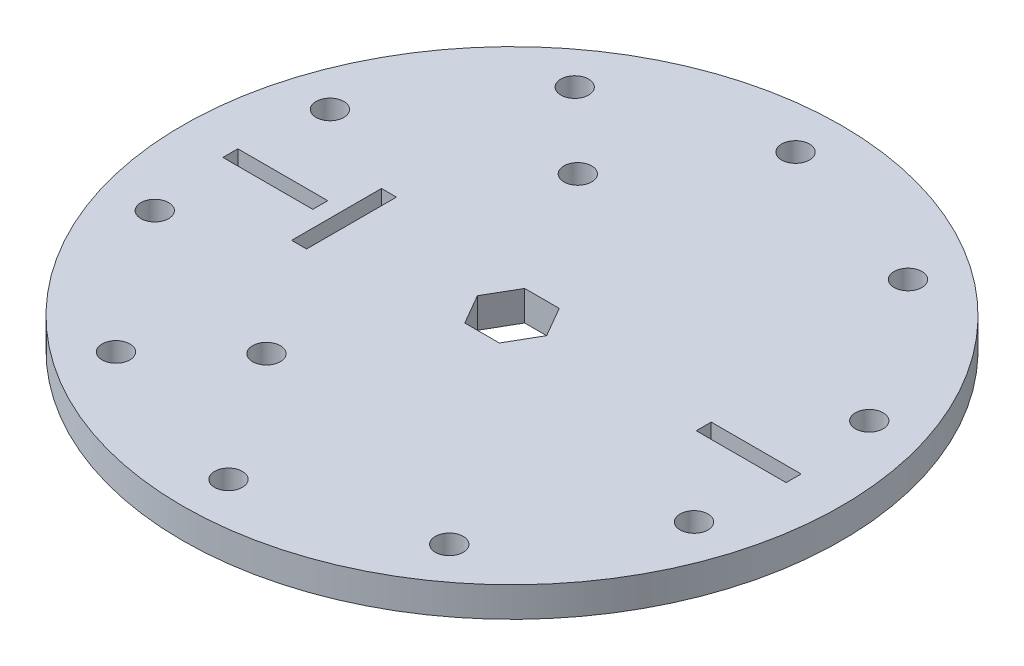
ISO-10303-21;
HEADER;
FILE_DESCRIPTION(('STEP AP214'),'2;1');
FILE_NAME('part.step','',(''),(''),'','','');
FILE_SCHEMA(('AUTOMOTIVE_DESIGN { 1 0 10303 214 1 1 1 1 }'));
ENDSEC;
DATA;
#1=APPLICATION_CONTEXT('core data for automotive mechanical design processes');
#2=APPLICATION_PROTOCOL_DEFINITION('international standard','automotive_design',2000,#1);
#3=PRODUCT_CONTEXT('',#1,'mechanical');
#4=PRODUCT('Part','Part','',(#3));
#5=PRODUCT_RELATED_PRODUCT_CATEGORY('part','',(#4));
#6=PRODUCT_DEFINITION_FORMATION('','',#4);
#7=PRODUCT_DEFINITION_CONTEXT('part definition',#1,'design');
#8=PRODUCT_DEFINITION('design','',#6,#7);
#9=PRODUCT_DEFINITION_SHAPE('','',#8);
#10=(LENGTH_UNIT() NAMED_UNIT(*) SI_UNIT(.MILLI.,.METRE.));
#11=(NAMED_UNIT(*) PLANE_ANGLE_UNIT() SI_UNIT($,.RADIAN.));
#12=(NAMED_UNIT(*) SI_UNIT($,.STERADIAN.) SOLID_ANGLE_UNIT());
#13=UNCERTAINTY_MEASURE_WITH_UNIT(LENGTH_MEASURE(1.E-05),#10,'distance_accuracy_value','');
#14=(GEOMETRIC_REPRESENTATION_CONTEXT(3) GLOBAL_UNCERTAINTY_ASSIGNED_CONTEXT((#13)) GLOBAL_UNIT_ASSIGNED_CONTEXT((#10,
#11,#12)) REPRESENTATION_CONTEXT('',''));
#15=CARTESIAN_POINT('',(0.,0.,0.));
#16=DIRECTION('',(0.,0.,1.));
#17=DIRECTION('',(1.,0.,0.));
#18=AXIS2_PLACEMENT_3D('',#15,#16,#17);
#19=CARTESIAN_POINT('',(0.,3.175,0.));
#20=DIRECTION('',(0.,1.,0.));
#21=DIRECTION('',(0.,0.,1.));
#22=AXIS2_PLACEMENT_3D('',#19,#20,#21);
#23=PLANE('',#22);
#24=DIRECTION('',(0.,0.,1.));
#25=VECTOR('',#24,1.);
#26=CARTESIAN_POINT('',(-18.5938102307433,3.175,-4.7625));
#27=LINE('',#26,#25);
#28=CARTESIAN_POINT('',(-18.5938102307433,3.175,-4.7625));
#29=VERTEX_POINT('',#28);
#30=CARTESIAN_POINT('',(-18.5938102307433,3.175,4.7625));
#31=VERTEX_POINT('',#30);
#32=EDGE_CURVE('E50',#29,#31,#27,.T.);
#33=ORIENTED_EDGE('',*,*,#32,.F.);
#34=DIRECTION('',(-1.,0.,0.));
#35=VECTOR('',#34,1.);
#36=CARTESIAN_POINT('',(-18.5938102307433,3.175,-4.7625));
#37=LINE('',#36,#35);
#38=CARTESIAN_POINT('',(-17.0063102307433,3.175,-4.7625));
#39=VERTEX_POINT('',#38);
#40=EDGE_CURVE('E178',#39,#29,#37,.T.);
#41=ORIENTED_EDGE('',*,*,#40,.F.);
#42=DIRECTION('',(0.,0.,-1.));
#43=VECTOR('',#42,1.);
#44=CARTESIAN_POINT('',(-17.0063102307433,3.175,-4.7625));
#45=LINE('',#44,#43);
#46=CARTESIAN_POINT('',(-17.0063102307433,3.175,4.7625));
#47=VERTEX_POINT('',#46);
#48=EDGE_CURVE('E181',#47,#39,#45,.T.);
#49=ORIENTED_EDGE('',*,*,#48,.F.);
#50=DIRECTION('',(1.,0.,0.));
#51=VECTOR('',#50,1.);
#52=CARTESIAN_POINT('',(-18.5938102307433,3.175,4.7625));
#53=LINE('',#52,#51);
#54=EDGE_CURVE('E187',#31,#47,#53,.T.);
#55=ORIENTED_EDGE('',*,*,#54,.F.);
#56=EDGE_LOOP('',(#33,#41,#49,#55));
#57=FACE_BOUND('',#56,.T.);
#58=DIRECTION('',(-1.,0.,0.));
#59=VECTOR('',#58,1.);
#60=CARTESIAN_POINT('',(29.845,3.175,-0.793749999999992));
#61=LINE('',#60,#59);
#62=CARTESIAN_POINT('',(29.845,3.175,-0.793749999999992));
#63=VERTEX_POINT('',#62);
#64=CARTESIAN_POINT('',(20.32,3.175,-0.793749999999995));
#65=VERTEX_POINT('',#64);
#66=EDGE_CURVE('E193',#63,#65,#61,.T.);
#67=ORIENTED_EDGE('',*,*,#66,.F.);
#68=DIRECTION('',(0.,0.,-1.));
#69=VECTOR('',#68,1.);
#70=CARTESIAN_POINT('',(29.845,3.175,-0.793749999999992));
#71=LINE('',#70,#69);
#72=CARTESIAN_POINT('',(29.845,3.175,0.793749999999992));
#73=VERTEX_POINT('',#72);
#74=EDGE_CURVE('E201',#73,#63,#71,.T.);
#75=ORIENTED_EDGE('',*,*,#74,.F.);
#76=DIRECTION('',(1.,0.,0.));
#77=VECTOR('',#76,1.);
#78=CARTESIAN_POINT('',(29.845,3.175,0.793749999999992));
#79=LINE('',#78,#77);
#80=CARTESIAN_POINT('',(20.32,3.175,0.793749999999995));
#81=VERTEX_POINT('',#80);
#82=EDGE_CURVE('E215',#81,#73,#79,.T.);
#83=ORIENTED_EDGE('',*,*,#82,.F.);
#84=DIRECTION('',(0.,0.,1.));
#85=VECTOR('',#84,1.);
#86=CARTESIAN_POINT('',(20.32,3.175,-0.793749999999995));
#87=LINE('',#86,#85);
#88=EDGE_CURVE('E212',#65,#81,#87,.T.);
#89=ORIENTED_EDGE('',*,*,#88,.F.);
#90=EDGE_LOOP('',(#67,#75,#83,#89));
#91=FACE_BOUND('',#90,.T.);
#92=DIRECTION('',(0.,0.,1.));
#93=VECTOR('',#92,1.);
#94=CARTESIAN_POINT('',(-29.845,3.175,-0.79375));
#95=LINE('',#94,#93);
#96=CARTESIAN_POINT('',(-29.845,3.175,-0.79375));
#97=VERTEX_POINT('',#96);
#98=CARTESIAN_POINT('',(-29.845,3.175,0.79375));
#99=VERTEX_POINT('',#98);
#100=EDGE_CURVE('E222',#97,#99,#95,.T.);
#101=ORIENTED_EDGE('',*,*,#100,.F.);
#102=DIRECTION('',(-1.,0.,0.));
#103=VECTOR('',#102,1.);
#104=CARTESIAN_POINT('',(-29.845,3.175,-0.79375));
#105=LINE('',#104,#103);
#106=CARTESIAN_POINT('',(-20.32,3.175,-0.79375));
#107=VERTEX_POINT('',#106);
#108=EDGE_CURVE('E233',#107,#97,#105,.T.);
#109=ORIENTED_EDGE('',*,*,#108,.F.);
#110=DIRECTION('',(0.,0.,-1.));
#111=VECTOR('',#110,1.);
#112=CARTESIAN_POINT('',(-20.32,3.175,-0.79375));
#113=LINE('',#112,#111);
#114=CARTESIAN_POINT('',(-20.32,3.175,0.79375));
#115=VERTEX_POINT('',#114);
#116=EDGE_CURVE('E247',#115,#107,#113,.T.);
#117=ORIENTED_EDGE('',*,*,#116,.F.);
#118=DIRECTION('',(1.,0.,0.));
#119=VECTOR('',#118,1.);
#120=CARTESIAN_POINT('',(-29.845,3.175,0.79375));
#121=LINE('',#120,#119);
#122=EDGE_CURVE('E244',#99,#115,#121,.T.);
#123=ORIENTED_EDGE('',*,*,#122,.F.);
#124=EDGE_LOOP('',(#101,#109,#117,#123));
#125=FACE_BOUND('',#124,.T.);
#126=CARTESIAN_POINT('',(-9.52499999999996,3.175,-16.4977839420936));
#127=DIRECTION('',(0.,1.,0.));
#128=DIRECTION('',(0.,0.,1.));
#129=AXIS2_PLACEMENT_3D('',#126,#127,#128);
#130=CIRCLE('',#129,1.47319999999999);
#131=CARTESIAN_POINT('',(-9.52499999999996,3.175,-15.0245839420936));
#132=VERTEX_POINT('',#131);
#133=EDGE_CURVE('E254',#132,#132,#130,.T.);
#134=ORIENTED_EDGE('',*,*,#133,.F.);
#135=EDGE_LOOP('',(#134));
#136=FACE_BOUND('',#135,.T.);
#137=CARTESIAN_POINT('',(-9.52499999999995,3.175,16.4977839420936));
#138=DIRECTION('',(0.,1.,0.));
#139=DIRECTION('',(0.,0.,1.));
#140=AXIS2_PLACEMENT_3D('',#137,#138,#139);
#141=CIRCLE('',#140,1.47319999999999);
#142=CARTESIAN_POINT('',(-9.52499999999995,3.175,17.9709839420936));
#143=VERTEX_POINT('',#142);
#144=EDGE_CURVE('E266',#143,#143,#141,.T.);
#145=ORIENTED_EDGE('',*,*,#144,.F.);
#146=EDGE_LOOP('',(#145));
#147=FACE_BOUND('',#146,.T.);
#148=CARTESIAN_POINT('',(0.,3.175,-30.0455330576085));
#149=DIRECTION('',(0.,1.,0.));
#150=DIRECTION('',(0.,0.,1.));
#151=AXIS2_PLACEMENT_3D('',#148,#149,#150);
#152=CIRCLE('',#151,1.4732);
#153=CARTESIAN_POINT('',(0.,3.175,-28.5723330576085));
#154=VERTEX_POINT('',#153);
#155=EDGE_CURVE('E272',#154,#154,#152,.T.);
#156=ORIENTED_EDGE('',*,*,#155,.F.);
#157=EDGE_LOOP('',(#156));
#158=FACE_BOUND('',#157,.T.);
#159=CARTESIAN_POINT('',(-17.6603212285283,3.175,-24.3073468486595));
#160=DIRECTION('',(0.,1.,0.));
#161=DIRECTION('',(0.,0.,1.));
#162=AXIS2_PLACEMENT_3D('',#159,#160,#161);
#163=CIRCLE('',#162,1.4732);
#164=CARTESIAN_POINT('',(-17.6603212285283,3.175,-22.8341468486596));
#165=VERTEX_POINT('',#164);
#166=EDGE_CURVE('E278',#165,#165,#163,.T.);
#167=ORIENTED_EDGE('',*,*,#166,.F.);
#168=EDGE_LOOP('',(#167));
#169=FACE_BOUND('',#168,.T.);
#170=CARTESIAN_POINT('',(-28.575,3.175,-9.2845803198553));
#171=DIRECTION('',(0.,1.,0.));
#172=DIRECTION('',(0.,0.,1.));
#173=AXIS2_PLACEMENT_3D('',#170,#171,#172);
#174=CIRCLE('',#173,1.4732);
#175=CARTESIAN_POINT('',(-28.575,3.175,-7.8113803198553));
#176=VERTEX_POINT('',#175);
#177=EDGE_CURVE('E284',#176,#176,#174,.T.);
#178=ORIENTED_EDGE('',*,*,#177,.F.);
#179=EDGE_LOOP('',(#178));
#180=FACE_BOUND('',#179,.T.);
#181=CARTESIAN_POINT('',(-28.575,3.175,9.28458031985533));
#182=DIRECTION('',(0.,1.,0.));
#183=DIRECTION('',(0.,0.,1.));
#184=AXIS2_PLACEMENT_3D('',#181,#182,#183);
#185=CIRCLE('',#184,1.4732);
#186=CARTESIAN_POINT('',(-28.575,3.175,10.7577803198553));
#187=VERTEX_POINT('',#186);
#188=EDGE_CURVE('E290',#187,#187,#185,.T.);
#189=ORIENTED_EDGE('',*,*,#188,.F.);
#190=EDGE_LOOP('',(#189));
#191=FACE_BOUND('',#190,.T.);
#192=CARTESIAN_POINT('',(-17.6603212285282,3.175,24.3073468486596));
#193=DIRECTION('',(0.,1.,0.));
#194=DIRECTION('',(0.,0.,1.));
#195=AXIS2_PLACEMENT_3D('',#192,#193,#194);
#196=CIRCLE('',#195,1.4732);
#197=CARTESIAN_POINT('',(-17.6603212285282,3.175,25.7805468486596));
#198=VERTEX_POINT('',#197);
#199=EDGE_CURVE('E296',#198,#198,#196,.T.);
#200=ORIENTED_EDGE('',*,*,#199,.F.);
#201=EDGE_LOOP('',(#200));
#202=FACE_BOUND('',#201,.T.);
#203=CARTESIAN_POINT('',(0.,3.175,30.0455330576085));
#204=DIRECTION('',(0.,1.,0.));
#205=DIRECTION('',(0.,0.,1.));
#206=AXIS2_PLACEMENT_3D('',#203,#204,#205);
#207=CIRCLE('',#206,1.4732);
#208=CARTESIAN_POINT('',(0.,3.175,31.5187330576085));
#209=VERTEX_POINT('',#208);
#210=EDGE_CURVE('E302',#209,#209,#207,.T.);
#211=ORIENTED_EDGE('',*,*,#210,.F.);
#212=EDGE_LOOP('',(#211));
#213=FACE_BOUND('',#212,.T.);
#214=CARTESIAN_POINT('',(17.6603212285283,3.175,24.3073468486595));
#215=DIRECTION('',(0.,1.,0.));
#216=DIRECTION('',(0.,0.,1.));
#217=AXIS2_PLACEMENT_3D('',#214,#215,#216);
#218=CIRCLE('',#217,1.4732);
#219=CARTESIAN_POINT('',(17.6603212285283,3.175,25.7805468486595));
#220=VERTEX_POINT('',#219);
#221=EDGE_CURVE('E308',#220,#220,#218,.T.);
#222=ORIENTED_EDGE('',*,*,#221,.F.);
#223=EDGE_LOOP('',(#222));
#224=FACE_BOUND('',#223,.T.);
#225=CARTESIAN_POINT('',(28.575,3.175,9.28458031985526));
#226=DIRECTION('',(0.,1.,0.));
#227=DIRECTION('',(0.,0.,1.));
#228=AXIS2_PLACEMENT_3D('',#225,#226,#227);
#229=CIRCLE('',#228,1.4732);
#230=CARTESIAN_POINT('',(28.575,3.175,10.7577803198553));
#231=VERTEX_POINT('',#230);
#232=EDGE_CURVE('E314',#231,#231,#229,.T.);
#233=ORIENTED_EDGE('',*,*,#232,.F.);
#234=EDGE_LOOP('',(#233));
#235=FACE_BOUND('',#234,.T.);
#236=CARTESIAN_POINT('',(28.575,3.175,-9.28458031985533));
#237=DIRECTION('',(0.,1.,0.));
#238=DIRECTION('',(0.,0.,1.));
#239=AXIS2_PLACEMENT_3D('',#236,#237,#238);
#240=CIRCLE('',#239,1.4732);
#241=CARTESIAN_POINT('',(28.575,3.175,-7.81138031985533));
#242=VERTEX_POINT('',#241);
#243=EDGE_CURVE('E320',#242,#242,#240,.T.);
#244=ORIENTED_EDGE('',*,*,#243,.F.);
#245=EDGE_LOOP('',(#244));
#246=FACE_BOUND('',#245,.T.);
#247=CARTESIAN_POINT('',(17.6603212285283,3.175,-24.3073468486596));
#248=DIRECTION('',(0.,1.,0.));
#249=DIRECTION('',(0.,0.,1.));
#250=AXIS2_PLACEMENT_3D('',#247,#248,#249);
#251=CIRCLE('',#250,1.4732);
#252=CARTESIAN_POINT('',(17.6603212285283,3.175,-22.8341468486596));
#253=VERTEX_POINT('',#252);
#254=EDGE_CURVE('E326',#253,#253,#251,.T.);
#255=ORIENTED_EDGE('',*,*,#254,.F.);
#256=EDGE_LOOP('',(#255));
#257=FACE_BOUND('',#256,.T.);
#258=CARTESIAN_POINT('',(0.,3.175,0.));
#259=DIRECTION('',(0.,1.,0.));
#260=DIRECTION('',(0.,0.,1.));
#261=AXIS2_PLACEMENT_3D('',#258,#259,#260);
#262=CIRCLE('',#261,34.925);
#263=CARTESIAN_POINT('',(0.,3.175,34.925));
#264=VERTEX_POINT('',#263);
#265=EDGE_CURVE('E11',#264,#264,#262,.T.);
#266=ORIENTED_EDGE('',*,*,#265,.T.);
#267=EDGE_LOOP('',(#266));
#268=FACE_BOUND('',#267,.T.);
#269=DIRECTION('',(-1.,0.,0.));
#270=VECTOR('',#269,1.);
#271=CARTESIAN_POINT('',(1.83308710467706,3.175,-3.175));
#272=LINE('',#271,#270);
#273=CARTESIAN_POINT('',(1.83308710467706,3.175,-3.175));
#274=VERTEX_POINT('',#273);
#275=CARTESIAN_POINT('',(-1.83308710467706,3.175,-3.175));
#276=VERTEX_POINT('',#275);
#277=EDGE_CURVE('E335',#274,#276,#272,.T.);
#278=ORIENTED_EDGE('',*,*,#277,.F.);
#279=DIRECTION('',(-0.5,0.,-0.866025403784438));
#280=VECTOR('',#279,1.);
#281=CARTESIAN_POINT('',(3.66617420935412,3.175,0.));
#282=LINE('',#281,#280);
#283=CARTESIAN_POINT('',(3.66617420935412,3.175,0.));
#284=VERTEX_POINT('',#283);
#285=EDGE_CURVE('E333',#284,#274,#282,.T.);
#286=ORIENTED_EDGE('',*,*,#285,.F.);
#287=DIRECTION('',(0.5,0.,-0.866025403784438));
#288=VECTOR('',#287,1.);
#289=CARTESIAN_POINT('',(1.83308710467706,3.175,3.175));
#290=LINE('',#289,#288);
#291=CARTESIAN_POINT('',(1.83308710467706,3.175,3.175));
#292=VERTEX_POINT('',#291);
#293=EDGE_CURVE('E345',#292,#284,#290,.T.);
#294=ORIENTED_EDGE('',*,*,#293,.F.);
#295=DIRECTION('',(1.,0.,0.));
#296=VECTOR('',#295,1.);
#297=CARTESIAN_POINT('',(-1.83308710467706,3.175,3.175));
#298=LINE('',#297,#296);
#299=CARTESIAN_POINT('',(-1.83308710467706,3.175,3.175));
#300=VERTEX_POINT('',#299);
#301=EDGE_CURVE('E342',#300,#292,#298,.T.);
#302=ORIENTED_EDGE('',*,*,#301,.F.);
#303=DIRECTION('',(0.5,0.,0.866025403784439));
#304=VECTOR('',#303,1.);
#305=CARTESIAN_POINT('',(-3.66617420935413,3.175,0.));
#306=LINE('',#305,#304);
#307=CARTESIAN_POINT('',(-3.66617420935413,3.175,0.));
#308=VERTEX_POINT('',#307);
#309=EDGE_CURVE('E340',#308,#300,#306,.T.);
#310=ORIENTED_EDGE('',*,*,#309,.F.);
#311=DIRECTION('',(-0.5,0.,0.866025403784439));
#312=VECTOR('',#311,1.);
#313=CARTESIAN_POINT('',(-1.83308710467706,3.175,-3.175));
#314=LINE('',#313,#312);
#315=EDGE_CURVE('E338',#276,#308,#314,.T.);
#316=ORIENTED_EDGE('',*,*,#315,.F.);
#317=EDGE_LOOP('',(#278,#286,#294,#302,#310,#316));
#318=FACE_BOUND('',#317,.T.);
#319=ADVANCED_FACE('F35',(#57,#91,#125,#136,#147,#158,#169,#180,#191,#202,#213,#224,#235,#246,
#257,#268,#318),#23,.T.);
#320=CARTESIAN_POINT('',(0.,0.,0.));
#321=DIRECTION('',(0.,1.,0.));
#322=DIRECTION('',(0.,0.,1.));
#323=AXIS2_PLACEMENT_3D('',#320,#321,#322);
#324=PLANE('',#323);
#325=DIRECTION('',(-1.,0.,0.));
#326=VECTOR('',#325,1.);
#327=CARTESIAN_POINT('',(-18.5938102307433,0.,-4.7625));
#328=LINE('',#327,#326);
#329=CARTESIAN_POINT('',(-17.0063102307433,0.,-4.7625));
#330=VERTEX_POINT('',#329);
#331=CARTESIAN_POINT('',(-18.5938102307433,0.,-4.7625));
#332=VERTEX_POINT('',#331);
#333=EDGE_CURVE('E168',#330,#332,#328,.T.);
#334=ORIENTED_EDGE('',*,*,#333,.T.);
#335=DIRECTION('',(0.,0.,1.));
#336=VECTOR('',#335,1.);
#337=CARTESIAN_POINT('',(-18.5938102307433,0.,-4.7625));
#338=LINE('',#337,#336);
#339=CARTESIAN_POINT('',(-18.5938102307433,0.,4.7625));
#340=VERTEX_POINT('',#339);
#341=EDGE_CURVE('E162',#332,#340,#338,.T.);
#342=ORIENTED_EDGE('',*,*,#341,.T.);
#343=DIRECTION('',(1.,0.,0.));
#344=VECTOR('',#343,1.);
#345=CARTESIAN_POINT('',(-18.5938102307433,0.,4.7625));
#346=LINE('',#345,#344);
#347=CARTESIAN_POINT('',(-17.0063102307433,0.,4.7625));
#348=VERTEX_POINT('',#347);
#349=EDGE_CURVE('E171',#340,#348,#346,.T.);
#350=ORIENTED_EDGE('',*,*,#349,.T.);
#351=DIRECTION('',(0.,0.,-1.));
#352=VECTOR('',#351,1.);
#353=CARTESIAN_POINT('',(-17.0063102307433,0.,-4.7625));
#354=LINE('',#353,#352);
#355=EDGE_CURVE('E58',#348,#330,#354,.T.);
#356=ORIENTED_EDGE('',*,*,#355,.T.);
#357=EDGE_LOOP('',(#334,#342,#350,#356));
#358=FACE_BOUND('',#357,.T.);
#359=DIRECTION('',(0.,0.,-1.));
#360=VECTOR('',#359,1.);
#361=CARTESIAN_POINT('',(29.845,0.,-0.793749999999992));
#362=LINE('',#361,#360);
#363=CARTESIAN_POINT('',(29.845,0.,0.793749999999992));
#364=VERTEX_POINT('',#363);
#365=CARTESIAN_POINT('',(29.845,0.,-0.793749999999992));
#366=VERTEX_POINT('',#365);
#367=EDGE_CURVE('E207',#364,#366,#362,.T.);
#368=ORIENTED_EDGE('',*,*,#367,.T.);
#369=DIRECTION('',(-1.,0.,0.));
#370=VECTOR('',#369,1.);
#371=CARTESIAN_POINT('',(29.845,0.,-0.793749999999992));
#372=LINE('',#371,#370);
#373=CARTESIAN_POINT('',(20.32,0.,-0.793749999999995));
#374=VERTEX_POINT('',#373);
#375=EDGE_CURVE('E197',#366,#374,#372,.T.);
#376=ORIENTED_EDGE('',*,*,#375,.T.);
#377=DIRECTION('',(0.,0.,1.));
#378=VECTOR('',#377,1.);
#379=CARTESIAN_POINT('',(20.32,0.,-0.793749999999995));
#380=LINE('',#379,#378);
#381=CARTESIAN_POINT('',(20.32,0.,0.793749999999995));
#382=VERTEX_POINT('',#381);
#383=EDGE_CURVE('E200',#374,#382,#380,.T.);
#384=ORIENTED_EDGE('',*,*,#383,.T.);
#385=DIRECTION('',(1.,0.,0.));
#386=VECTOR('',#385,1.);
#387=CARTESIAN_POINT('',(29.845,0.,0.793749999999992));
#388=LINE('',#387,#386);
#389=EDGE_CURVE('E204',#382,#364,#388,.T.);
#390=ORIENTED_EDGE('',*,*,#389,.T.);
#391=EDGE_LOOP('',(#368,#376,#384,#390));
#392=FACE_BOUND('',#391,.T.);
#393=DIRECTION('',(-1.,0.,0.));
#394=VECTOR('',#393,1.);
#395=CARTESIAN_POINT('',(-29.845,0.,-0.79375));
#396=LINE('',#395,#394);
#397=CARTESIAN_POINT('',(-20.32,0.,-0.79375));
#398=VERTEX_POINT('',#397);
#399=CARTESIAN_POINT('',(-29.845,0.,-0.79375));
#400=VERTEX_POINT('',#399);
#401=EDGE_CURVE('E239',#398,#400,#396,.T.);
#402=ORIENTED_EDGE('',*,*,#401,.T.);
#403=DIRECTION('',(0.,0.,1.));
#404=VECTOR('',#403,1.);
#405=CARTESIAN_POINT('',(-29.845,0.,-0.79375));
#406=LINE('',#405,#404);
#407=CARTESIAN_POINT('',(-29.845,0.,0.79375));
#408=VERTEX_POINT('',#407);
#409=EDGE_CURVE('E229',#400,#408,#406,.T.);
#410=ORIENTED_EDGE('',*,*,#409,.T.);
#411=DIRECTION('',(1.,0.,0.));
#412=VECTOR('',#411,1.);
#413=CARTESIAN_POINT('',(-29.845,0.,0.79375));
#414=LINE('',#413,#412);
#415=CARTESIAN_POINT('',(-20.32,0.,0.79375));
#416=VERTEX_POINT('',#415);
#417=EDGE_CURVE('E232',#408,#416,#414,.T.);
#418=ORIENTED_EDGE('',*,*,#417,.T.);
#419=DIRECTION('',(0.,0.,-1.));
#420=VECTOR('',#419,1.);
#421=CARTESIAN_POINT('',(-20.32,0.,-0.79375));
#422=LINE('',#421,#420);
#423=EDGE_CURVE('E236',#416,#398,#422,.T.);
#424=ORIENTED_EDGE('',*,*,#423,.T.);
#425=EDGE_LOOP('',(#402,#410,#418,#424));
#426=FACE_BOUND('',#425,.T.);
#427=CARTESIAN_POINT('',(-9.52499999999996,0.,-16.4977839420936));
#428=DIRECTION('',(0.,1.,0.));
#429=DIRECTION('',(0.,0.,1.));
#430=AXIS2_PLACEMENT_3D('',#427,#428,#429);
#431=CIRCLE('',#430,1.4732);
#432=CARTESIAN_POINT('',(-9.52499999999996,0.,-15.0245839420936));
#433=VERTEX_POINT('',#432);
#434=EDGE_CURVE('E263',#433,#433,#431,.T.);
#435=ORIENTED_EDGE('',*,*,#434,.T.);
#436=EDGE_LOOP('',(#435));
#437=FACE_BOUND('',#436,.T.);
#438=CARTESIAN_POINT('',(-9.52499999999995,0.,16.4977839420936));
#439=DIRECTION('',(0.,1.,0.));
#440=DIRECTION('',(0.,0.,1.));
#441=AXIS2_PLACEMENT_3D('',#438,#439,#440);
#442=CIRCLE('',#441,1.4732);
#443=CARTESIAN_POINT('',(-9.52499999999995,0.,17.9709839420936));
#444=VERTEX_POINT('',#443);
#445=EDGE_CURVE('E269',#444,#444,#442,.T.);
#446=ORIENTED_EDGE('',*,*,#445,.T.);
#447=EDGE_LOOP('',(#446));
#448=FACE_BOUND('',#447,.T.);
#449=CARTESIAN_POINT('',(0.,0.,-30.0455330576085));
#450=DIRECTION('',(0.,1.,0.));
#451=DIRECTION('',(0.,0.,1.));
#452=AXIS2_PLACEMENT_3D('',#449,#450,#451);
#453=CIRCLE('',#452,1.4732);
#454=CARTESIAN_POINT('',(0.,0.,-28.5723330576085));
#455=VERTEX_POINT('',#454);
#456=EDGE_CURVE('E275',#455,#455,#453,.T.);
#457=ORIENTED_EDGE('',*,*,#456,.T.);
#458=EDGE_LOOP('',(#457));
#459=FACE_BOUND('',#458,.T.);
#460=CARTESIAN_POINT('',(-17.6603212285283,0.,-24.3073468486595));
#461=DIRECTION('',(0.,1.,0.));
#462=DIRECTION('',(0.,0.,1.));
#463=AXIS2_PLACEMENT_3D('',#460,#461,#462);
#464=CIRCLE('',#463,1.4732);
#465=CARTESIAN_POINT('',(-17.6603212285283,0.,-22.8341468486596));
#466=VERTEX_POINT('',#465);
#467=EDGE_CURVE('E281',#466,#466,#464,.T.);
#468=ORIENTED_EDGE('',*,*,#467,.T.);
#469=EDGE_LOOP('',(#468));
#470=FACE_BOUND('',#469,.T.);
#471=CARTESIAN_POINT('',(-28.575,0.,-9.2845803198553));
#472=DIRECTION('',(0.,1.,0.));
#473=DIRECTION('',(0.,0.,1.));
#474=AXIS2_PLACEMENT_3D('',#471,#472,#473);
#475=CIRCLE('',#474,1.4732);
#476=CARTESIAN_POINT('',(-28.575,0.,-7.81138031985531));
#477=VERTEX_POINT('',#476);
#478=EDGE_CURVE('E287',#477,#477,#475,.T.);
#479=ORIENTED_EDGE('',*,*,#478,.T.);
#480=EDGE_LOOP('',(#479));
#481=FACE_BOUND('',#480,.T.);
#482=CARTESIAN_POINT('',(-28.575,0.,9.28458031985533));
#483=DIRECTION('',(0.,1.,0.));
#484=DIRECTION('',(0.,0.,1.));
#485=AXIS2_PLACEMENT_3D('',#482,#483,#484);
#486=CIRCLE('',#485,1.4732);
#487=CARTESIAN_POINT('',(-28.575,0.,10.7577803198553));
#488=VERTEX_POINT('',#487);
#489=EDGE_CURVE('E293',#488,#488,#486,.T.);
#490=ORIENTED_EDGE('',*,*,#489,.T.);
#491=EDGE_LOOP('',(#490));
#492=FACE_BOUND('',#491,.T.);
#493=CARTESIAN_POINT('',(-17.6603212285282,0.,24.3073468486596));
#494=DIRECTION('',(0.,1.,0.));
#495=DIRECTION('',(0.,0.,1.));
#496=AXIS2_PLACEMENT_3D('',#493,#494,#495);
#497=CIRCLE('',#496,1.4732);
#498=CARTESIAN_POINT('',(-17.6603212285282,0.,25.7805468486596));
#499=VERTEX_POINT('',#498);
#500=EDGE_CURVE('E299',#499,#499,#497,.T.);
#501=ORIENTED_EDGE('',*,*,#500,.T.);
#502=EDGE_LOOP('',(#501));
#503=FACE_BOUND('',#502,.T.);
#504=CARTESIAN_POINT('',(0.,0.,30.0455330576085));
#505=DIRECTION('',(0.,1.,0.));
#506=DIRECTION('',(0.,0.,1.));
#507=AXIS2_PLACEMENT_3D('',#504,#505,#506);
#508=CIRCLE('',#507,1.4732);
#509=CARTESIAN_POINT('',(0.,0.,31.5187330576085));
#510=VERTEX_POINT('',#509);
#511=EDGE_CURVE('E305',#510,#510,#508,.T.);
#512=ORIENTED_EDGE('',*,*,#511,.T.);
#513=EDGE_LOOP('',(#512));
#514=FACE_BOUND('',#513,.T.);
#515=CARTESIAN_POINT('',(17.6603212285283,0.,24.3073468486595));
#516=DIRECTION('',(0.,1.,0.));
#517=DIRECTION('',(0.,0.,1.));
#518=AXIS2_PLACEMENT_3D('',#515,#516,#517);
#519=CIRCLE('',#518,1.4732);
#520=CARTESIAN_POINT('',(17.6603212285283,0.,25.7805468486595));
#521=VERTEX_POINT('',#520);
#522=EDGE_CURVE('E311',#521,#521,#519,.T.);
#523=ORIENTED_EDGE('',*,*,#522,.T.);
#524=EDGE_LOOP('',(#523));
#525=FACE_BOUND('',#524,.T.);
#526=CARTESIAN_POINT('',(28.575,0.,9.28458031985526));
#527=DIRECTION('',(0.,1.,0.));
#528=DIRECTION('',(0.,0.,1.));
#529=AXIS2_PLACEMENT_3D('',#526,#527,#528);
#530=CIRCLE('',#529,1.4732);
#531=CARTESIAN_POINT('',(28.575,0.,10.7577803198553));
#532=VERTEX_POINT('',#531);
#533=EDGE_CURVE('E317',#532,#532,#530,.T.);
#534=ORIENTED_EDGE('',*,*,#533,.T.);
#535=EDGE_LOOP('',(#534));
#536=FACE_BOUND('',#535,.T.);
#537=CARTESIAN_POINT('',(28.575,0.,-9.28458031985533));
#538=DIRECTION('',(0.,1.,0.));
#539=DIRECTION('',(0.,0.,1.));
#540=AXIS2_PLACEMENT_3D('',#537,#538,#539);
#541=CIRCLE('',#540,1.4732);
#542=CARTESIAN_POINT('',(28.575,0.,-7.81138031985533));
#543=VERTEX_POINT('',#542);
#544=EDGE_CURVE('E323',#543,#543,#541,.T.);
#545=ORIENTED_EDGE('',*,*,#544,.T.);
#546=EDGE_LOOP('',(#545));
#547=FACE_BOUND('',#546,.T.);
#548=CARTESIAN_POINT('',(17.6603212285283,0.,-24.3073468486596));
#549=DIRECTION('',(0.,1.,0.));
#550=DIRECTION('',(0.,0.,1.));
#551=AXIS2_PLACEMENT_3D('',#548,#549,#550);
#552=CIRCLE('',#551,1.4732);
#553=CARTESIAN_POINT('',(17.6603212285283,0.,-22.8341468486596));
#554=VERTEX_POINT('',#553);
#555=EDGE_CURVE('E329',#554,#554,#552,.T.);
#556=ORIENTED_EDGE('',*,*,#555,.T.);
#557=EDGE_LOOP('',(#556));
#558=FACE_BOUND('',#557,.T.);
#559=CARTESIAN_POINT('',(0.,0.,0.));
#560=DIRECTION('',(0.,1.,0.));
#561=DIRECTION('',(0.,0.,1.));
#562=AXIS2_PLACEMENT_3D('',#559,#560,#561);
#563=CIRCLE('',#562,34.925);
#564=CARTESIAN_POINT('',(0.,0.,34.925));
#565=VERTEX_POINT('',#564);
#566=EDGE_CURVE('E39',#565,#565,#563,.T.);
#567=ORIENTED_EDGE('',*,*,#566,.F.);
#568=EDGE_LOOP('',(#567));
#569=FACE_BOUND('',#568,.T.);
#570=DIRECTION('',(-0.5,0.,-0.866025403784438));
#571=VECTOR('',#570,1.);
#572=CARTESIAN_POINT('',(3.66617420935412,0.,0.));
#573=LINE('',#572,#571);
#574=CARTESIAN_POINT('',(3.66617420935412,0.,0.));
#575=VERTEX_POINT('',#574);
#576=CARTESIAN_POINT('',(1.83308710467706,0.,-3.175));
#577=VERTEX_POINT('',#576);
#578=EDGE_CURVE('E332',#575,#577,#573,.T.);
#579=ORIENTED_EDGE('',*,*,#578,.T.);
#580=DIRECTION('',(-1.,0.,0.));
#581=VECTOR('',#580,1.);
#582=CARTESIAN_POINT('',(1.83308710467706,0.,-3.175));
#583=LINE('',#582,#581);
#584=CARTESIAN_POINT('',(-1.83308710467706,0.,-3.175));
#585=VERTEX_POINT('',#584);
#586=EDGE_CURVE('E350',#577,#585,#583,.T.);
#587=ORIENTED_EDGE('',*,*,#586,.T.);
#588=DIRECTION('',(-0.5,0.,0.866025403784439));
#589=VECTOR('',#588,1.);
#590=CARTESIAN_POINT('',(-1.83308710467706,0.,-3.175));
#591=LINE('',#590,#589);
#592=CARTESIAN_POINT('',(-3.66617420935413,0.,0.));
#593=VERTEX_POINT('',#592);
#594=EDGE_CURVE('E353',#585,#593,#591,.T.);
#595=ORIENTED_EDGE('',*,*,#594,.T.);
#596=DIRECTION('',(0.5,0.,0.866025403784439));
#597=VECTOR('',#596,1.);
#598=CARTESIAN_POINT('',(-3.66617420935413,0.,0.));
#599=LINE('',#598,#597);
#600=CARTESIAN_POINT('',(-1.83308710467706,0.,3.175));
#601=VERTEX_POINT('',#600);
#602=EDGE_CURVE('E356',#593,#601,#599,.T.);
#603=ORIENTED_EDGE('',*,*,#602,.T.);
#604=DIRECTION('',(1.,0.,0.));
#605=VECTOR('',#604,1.);
#606=CARTESIAN_POINT('',(-1.83308710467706,0.,3.175));
#607=LINE('',#606,#605);
#608=CARTESIAN_POINT('',(1.83308710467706,0.,3.175));
#609=VERTEX_POINT('',#608);
#610=EDGE_CURVE('E359',#601,#609,#607,.T.);
#611=ORIENTED_EDGE('',*,*,#610,.T.);
#612=DIRECTION('',(0.5,0.,-0.866025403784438));
#613=VECTOR('',#612,1.);
#614=CARTESIAN_POINT('',(1.83308710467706,0.,3.175));
#615=LINE('',#614,#613);
#616=EDGE_CURVE('E336',#609,#575,#615,.T.);
#617=ORIENTED_EDGE('',*,*,#616,.T.);
#618=EDGE_LOOP('',(#579,#587,#595,#603,#611,#617));
#619=FACE_BOUND('',#618,.T.);
#620=ADVANCED_FACE('F175',(#358,#392,#426,#437,#448,#459,#470,#481,#492,#503,#514,#525,#536,
#547,#558,#569,#619),#324,.F.);
#621=CARTESIAN_POINT('',(0.,3.175,0.));
#622=DIRECTION('',(0.,-1.,0.));
#623=DIRECTION('',(0.,0.,-1.));
#624=AXIS2_PLACEMENT_3D('',#621,#622,#623);
#625=CYLINDRICAL_SURFACE('',#624,34.925);
#626=ORIENTED_EDGE('',*,*,#265,.F.);
#627=EDGE_LOOP('',(#626));
#628=FACE_BOUND('',#627,.T.);
#629=ORIENTED_EDGE('',*,*,#566,.T.);
#630=EDGE_LOOP('',(#629));
#631=FACE_BOUND('',#630,.T.);
#632=ADVANCED_FACE('F37',(#628,#631),#625,.T.);
#633=CARTESIAN_POINT('',(3.66617420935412,3.175,0.));
#634=DIRECTION('',(-0.866025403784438,0.,0.5));
#635=DIRECTION('',(0.500000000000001,0.,0.866025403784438));
#636=AXIS2_PLACEMENT_3D('',#633,#634,#635);
#637=PLANE('',#636);
#638=ORIENTED_EDGE('',*,*,#578,.F.);
#639=DIRECTION('',(0.,-1.,0.));
#640=VECTOR('',#639,1.);
#641=CARTESIAN_POINT('',(3.66617420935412,3.175,0.));
#642=LINE('',#641,#640);
#643=EDGE_CURVE('E347',#284,#575,#642,.T.);
#644=ORIENTED_EDGE('',*,*,#643,.F.);
#645=ORIENTED_EDGE('',*,*,#285,.T.);
#646=DIRECTION('',(0.,-1.,0.));
#647=VECTOR('',#646,1.);
#648=CARTESIAN_POINT('',(1.83308710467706,3.175,-3.175));
#649=LINE('',#648,#647);
#650=EDGE_CURVE('E374',#274,#577,#649,.T.);
#651=ORIENTED_EDGE('',*,*,#650,.T.);
#652=EDGE_LOOP('',(#638,#644,#645,#651));
#653=FACE_BOUND('',#652,.T.);
#654=ADVANCED_FACE('F386',(#653),#637,.T.);
#655=CARTESIAN_POINT('',(1.83308710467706,3.175,-3.175));
#656=DIRECTION('',(0.,0.,1.));
#657=DIRECTION('',(1.,0.,0.));
#658=AXIS2_PLACEMENT_3D('',#655,#656,#657);
#659=PLANE('',#658);
#660=ORIENTED_EDGE('',*,*,#586,.F.);
#661=ORIENTED_EDGE('',*,*,#650,.F.);
#662=ORIENTED_EDGE('',*,*,#277,.T.);
#663=DIRECTION('',(0.,-1.,0.));
#664=VECTOR('',#663,1.);
#665=CARTESIAN_POINT('',(-1.83308710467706,3.175,-3.175));
#666=LINE('',#665,#664);
#667=EDGE_CURVE('E372',#276,#585,#666,.T.);
#668=ORIENTED_EDGE('',*,*,#667,.T.);
#669=EDGE_LOOP('',(#660,#661,#662,#668));
#670=FACE_BOUND('',#669,.T.);
#671=ADVANCED_FACE('F397',(#670),#659,.T.);
#672=CARTESIAN_POINT('',(-1.83308710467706,3.175,-3.175));
#673=DIRECTION('',(0.866025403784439,0.,0.5));
#674=DIRECTION('',(0.5,0.,-0.866025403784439));
#675=AXIS2_PLACEMENT_3D('',#672,#673,#674);
#676=PLANE('',#675);
#677=ORIENTED_EDGE('',*,*,#594,.F.);
#678=ORIENTED_EDGE('',*,*,#667,.F.);
#679=ORIENTED_EDGE('',*,*,#315,.T.);
#680=DIRECTION('',(0.,-1.,0.));
#681=VECTOR('',#680,1.);
#682=CARTESIAN_POINT('',(-3.66617420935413,3.175,0.));
#683=LINE('',#682,#681);
#684=EDGE_CURVE('E370',#308,#593,#683,.T.);
#685=ORIENTED_EDGE('',*,*,#684,.T.);
#686=EDGE_LOOP('',(#677,#678,#679,#685));
#687=FACE_BOUND('',#686,.T.);
#688=ADVANCED_FACE('F401',(#687),#676,.T.);
#689=CARTESIAN_POINT('',(-3.66617420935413,3.175,0.));
#690=DIRECTION('',(0.866025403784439,0.,-0.5));
#691=DIRECTION('',(-0.5,0.,-0.866025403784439));
#692=AXIS2_PLACEMENT_3D('',#689,#690,#691);
#693=PLANE('',#692);
#694=ORIENTED_EDGE('',*,*,#602,.F.);
#695=ORIENTED_EDGE('',*,*,#684,.F.);
#696=ORIENTED_EDGE('',*,*,#309,.T.);
#697=DIRECTION('',(0.,-1.,0.));
#698=VECTOR('',#697,1.);
#699=CARTESIAN_POINT('',(-1.83308710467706,3.175,3.175));
#700=LINE('',#699,#698);
#701=EDGE_CURVE('E368',#300,#601,#700,.T.);
#702=ORIENTED_EDGE('',*,*,#701,.T.);
#703=EDGE_LOOP('',(#694,#695,#696,#702));
#704=FACE_BOUND('',#703,.T.);
#705=ADVANCED_FACE('F406',(#704),#693,.T.);
#706=CARTESIAN_POINT('',(-1.83308710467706,3.175,3.175));
#707=DIRECTION('',(0.,0.,-1.));
#708=DIRECTION('',(-1.,0.,0.));
#709=AXIS2_PLACEMENT_3D('',#706,#707,#708);
#710=PLANE('',#709);
#711=ORIENTED_EDGE('',*,*,#610,.F.);
#712=ORIENTED_EDGE('',*,*,#701,.F.);
#713=ORIENTED_EDGE('',*,*,#301,.T.);
#714=DIRECTION('',(0.,-1.,0.));
#715=VECTOR('',#714,1.);
#716=CARTESIAN_POINT('',(1.83308710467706,3.175,3.175));
#717=LINE('',#716,#715);
#718=EDGE_CURVE('E366',#292,#609,#717,.T.);
#719=ORIENTED_EDGE('',*,*,#718,.T.);
#720=EDGE_LOOP('',(#711,#712,#713,#719));
#721=FACE_BOUND('',#720,.T.);
#722=ADVANCED_FACE('F409',(#721),#710,.T.);
#723=CARTESIAN_POINT('',(1.83308710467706,3.175,3.175));
#724=DIRECTION('',(-0.866025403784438,0.,-0.5));
#725=DIRECTION('',(-0.5,0.,0.866025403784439));
#726=AXIS2_PLACEMENT_3D('',#723,#724,#725);
#727=PLANE('',#726);
#728=ORIENTED_EDGE('',*,*,#616,.F.);
#729=ORIENTED_EDGE('',*,*,#718,.F.);
#730=ORIENTED_EDGE('',*,*,#293,.T.);
#731=ORIENTED_EDGE('',*,*,#643,.T.);
#732=EDGE_LOOP('',(#728,#729,#730,#731));
#733=FACE_BOUND('',#732,.T.);
#734=ADVANCED_FACE('F389',(#733),#727,.T.);
#735=CARTESIAN_POINT('',(17.6603212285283,3.175,-24.3073468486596));
#736=DIRECTION('',(0.,1.,0.));
#737=DIRECTION('',(0.,0.,1.));
#738=AXIS2_PLACEMENT_3D('',#735,#736,#737);
#739=CYLINDRICAL_SURFACE('',#738,1.4732);
#740=ORIENTED_EDGE('',*,*,#555,.F.);
#741=EDGE_LOOP('',(#740));
#742=FACE_BOUND('',#741,.T.);
#743=ORIENTED_EDGE('',*,*,#254,.T.);
#744=EDGE_LOOP('',(#743));
#745=FACE_BOUND('',#744,.T.);
#746=ADVANCED_FACE('F416',(#742,#745),#739,.F.);
#747=CARTESIAN_POINT('',(28.575,3.175,-9.28458031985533));
#748=DIRECTION('',(0.,1.,0.));
#749=DIRECTION('',(0.,0.,1.));
#750=AXIS2_PLACEMENT_3D('',#747,#748,#749);
#751=CYLINDRICAL_SURFACE('',#750,1.4732);
#752=ORIENTED_EDGE('',*,*,#544,.F.);
#753=EDGE_LOOP('',(#752));
#754=FACE_BOUND('',#753,.T.);
#755=ORIENTED_EDGE('',*,*,#243,.T.);
#756=EDGE_LOOP('',(#755));
#757=FACE_BOUND('',#756,.T.);
#758=ADVANCED_FACE('F458',(#754,#757),#751,.F.);
#759=CARTESIAN_POINT('',(28.575,3.175,9.28458031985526));
#760=DIRECTION('',(0.,1.,0.));
#761=DIRECTION('',(0.,0.,1.));
#762=AXIS2_PLACEMENT_3D('',#759,#760,#761);
#763=CYLINDRICAL_SURFACE('',#762,1.4732);
#764=ORIENTED_EDGE('',*,*,#533,.F.);
#765=EDGE_LOOP('',(#764));
#766=FACE_BOUND('',#765,.T.);
#767=ORIENTED_EDGE('',*,*,#232,.T.);
#768=EDGE_LOOP('',(#767));
#769=FACE_BOUND('',#768,.T.);
#770=ADVANCED_FACE('F468',(#766,#769),#763,.F.);
#771=CARTESIAN_POINT('',(17.6603212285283,3.175,24.3073468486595));
#772=DIRECTION('',(0.,1.,0.));
#773=DIRECTION('',(0.,0.,1.));
#774=AXIS2_PLACEMENT_3D('',#771,#772,#773);
#775=CYLINDRICAL_SURFACE('',#774,1.4732);
#776=ORIENTED_EDGE('',*,*,#522,.F.);
#777=EDGE_LOOP('',(#776));
#778=FACE_BOUND('',#777,.T.);
#779=ORIENTED_EDGE('',*,*,#221,.T.);
#780=EDGE_LOOP('',(#779));
#781=FACE_BOUND('',#780,.T.);
#782=ADVANCED_FACE('F478',(#778,#781),#775,.F.);
#783=CARTESIAN_POINT('',(0.,3.175,30.0455330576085));
#784=DIRECTION('',(0.,1.,0.));
#785=DIRECTION('',(0.,0.,1.));
#786=AXIS2_PLACEMENT_3D('',#783,#784,#785);
#787=CYLINDRICAL_SURFACE('',#786,1.4732);
#788=ORIENTED_EDGE('',*,*,#511,.F.);
#789=EDGE_LOOP('',(#788));
#790=FACE_BOUND('',#789,.T.);
#791=ORIENTED_EDGE('',*,*,#210,.T.);
#792=EDGE_LOOP('',(#791));
#793=FACE_BOUND('',#792,.T.);
#794=ADVANCED_FACE('F488',(#790,#793),#787,.F.);
#795=CARTESIAN_POINT('',(-17.6603212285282,3.175,24.3073468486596));
#796=DIRECTION('',(0.,1.,0.));
#797=DIRECTION('',(0.,0.,1.));
#798=AXIS2_PLACEMENT_3D('',#795,#796,#797);
#799=CYLINDRICAL_SURFACE('',#798,1.4732);
#800=ORIENTED_EDGE('',*,*,#500,.F.);
#801=EDGE_LOOP('',(#800));
#802=FACE_BOUND('',#801,.T.);
#803=ORIENTED_EDGE('',*,*,#199,.T.);
#804=EDGE_LOOP('',(#803));
#805=FACE_BOUND('',#804,.T.);
#806=ADVANCED_FACE('F498',(#802,#805),#799,.F.);
#807=CARTESIAN_POINT('',(-28.575,3.175,9.28458031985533));
#808=DIRECTION('',(0.,1.,0.));
#809=DIRECTION('',(0.,0.,1.));
#810=AXIS2_PLACEMENT_3D('',#807,#808,#809);
#811=CYLINDRICAL_SURFACE('',#810,1.4732);
#812=ORIENTED_EDGE('',*,*,#489,.F.);
#813=EDGE_LOOP('',(#812));
#814=FACE_BOUND('',#813,.T.);
#815=ORIENTED_EDGE('',*,*,#188,.T.);
#816=EDGE_LOOP('',(#815));
#817=FACE_BOUND('',#816,.T.);
#818=ADVANCED_FACE('F508',(#814,#817),#811,.F.);
#819=CARTESIAN_POINT('',(-28.575,3.175,-9.2845803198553));
#820=DIRECTION('',(0.,1.,0.));
#821=DIRECTION('',(0.,0.,1.));
#822=AXIS2_PLACEMENT_3D('',#819,#820,#821);
#823=CYLINDRICAL_SURFACE('',#822,1.4732);
#824=ORIENTED_EDGE('',*,*,#478,.F.);
#825=EDGE_LOOP('',(#824));
#826=FACE_BOUND('',#825,.T.);
#827=ORIENTED_EDGE('',*,*,#177,.T.);
#828=EDGE_LOOP('',(#827));
#829=FACE_BOUND('',#828,.T.);
#830=ADVANCED_FACE('F518',(#826,#829),#823,.F.);
#831=CARTESIAN_POINT('',(-17.6603212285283,3.175,-24.3073468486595));
#832=DIRECTION('',(0.,1.,0.));
#833=DIRECTION('',(0.,0.,1.));
#834=AXIS2_PLACEMENT_3D('',#831,#832,#833);
#835=CYLINDRICAL_SURFACE('',#834,1.4732);
#836=ORIENTED_EDGE('',*,*,#467,.F.);
#837=EDGE_LOOP('',(#836));
#838=FACE_BOUND('',#837,.T.);
#839=ORIENTED_EDGE('',*,*,#166,.T.);
#840=EDGE_LOOP('',(#839));
#841=FACE_BOUND('',#840,.T.);
#842=ADVANCED_FACE('F528',(#838,#841),#835,.F.);
#843=CARTESIAN_POINT('',(0.,3.175,-30.0455330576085));
#844=DIRECTION('',(0.,1.,0.));
#845=DIRECTION('',(0.,0.,1.));
#846=AXIS2_PLACEMENT_3D('',#843,#844,#845);
#847=CYLINDRICAL_SURFACE('',#846,1.4732);
#848=ORIENTED_EDGE('',*,*,#456,.F.);
#849=EDGE_LOOP('',(#848));
#850=FACE_BOUND('',#849,.T.);
#851=ORIENTED_EDGE('',*,*,#155,.T.);
#852=EDGE_LOOP('',(#851));
#853=FACE_BOUND('',#852,.T.);
#854=ADVANCED_FACE('F538',(#850,#853),#847,.F.);
#855=CARTESIAN_POINT('',(-9.52499999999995,3.175,16.4977839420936));
#856=DIRECTION('',(0.,1.,0.));
#857=DIRECTION('',(0.,0.,1.));
#858=AXIS2_PLACEMENT_3D('',#855,#856,#857);
#859=CYLINDRICAL_SURFACE('',#858,1.47319999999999);
#860=ORIENTED_EDGE('',*,*,#445,.F.);
#861=EDGE_LOOP('',(#860));
#862=FACE_BOUND('',#861,.T.);
#863=ORIENTED_EDGE('',*,*,#144,.T.);
#864=EDGE_LOOP('',(#863));
#865=FACE_BOUND('',#864,.T.);
#866=ADVANCED_FACE('F548',(#862,#865),#859,.F.);
#867=CARTESIAN_POINT('',(-9.52499999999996,3.175,-16.4977839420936));
#868=DIRECTION('',(0.,1.,0.));
#869=DIRECTION('',(0.,0.,1.));
#870=AXIS2_PLACEMENT_3D('',#867,#868,#869);
#871=CYLINDRICAL_SURFACE('',#870,1.47319999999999);
#872=ORIENTED_EDGE('',*,*,#434,.F.);
#873=EDGE_LOOP('',(#872));
#874=FACE_BOUND('',#873,.T.);
#875=ORIENTED_EDGE('',*,*,#133,.T.);
#876=EDGE_LOOP('',(#875));
#877=FACE_BOUND('',#876,.T.);
#878=ADVANCED_FACE('F558',(#874,#877),#871,.F.);
#879=CARTESIAN_POINT('',(-29.845,0.,-0.79375));
#880=DIRECTION('',(-1.,0.,0.));
#881=DIRECTION('',(0.,0.,1.));
#882=AXIS2_PLACEMENT_3D('',#879,#880,#881);
#883=PLANE('',#882);
#884=ORIENTED_EDGE('',*,*,#100,.T.);
#885=DIRECTION('',(0.,1.,0.));
#886=VECTOR('',#885,1.);
#887=CARTESIAN_POINT('',(-29.845,0.,0.79375));
#888=LINE('',#887,#886);
#889=EDGE_CURVE('E242',#408,#99,#888,.T.);
#890=ORIENTED_EDGE('',*,*,#889,.F.);
#891=ORIENTED_EDGE('',*,*,#409,.F.);
#892=DIRECTION('',(0.,1.,0.));
#893=VECTOR('',#892,1.);
#894=CARTESIAN_POINT('',(-29.845,0.,-0.79375));
#895=LINE('',#894,#893);
#896=EDGE_CURVE('E252',#400,#97,#895,.T.);
#897=ORIENTED_EDGE('',*,*,#896,.T.);
#898=EDGE_LOOP('',(#884,#890,#891,#897));
#899=FACE_BOUND('',#898,.T.);
#900=ADVANCED_FACE('F568',(#899),#883,.F.);
#901=CARTESIAN_POINT('',(-29.845,0.,-0.79375));
#902=DIRECTION('',(0.,0.,-1.));
#903=DIRECTION('',(-1.,0.,0.));
#904=AXIS2_PLACEMENT_3D('',#901,#902,#903);
#905=PLANE('',#904);
#906=ORIENTED_EDGE('',*,*,#108,.T.);
#907=ORIENTED_EDGE('',*,*,#896,.F.);
#908=ORIENTED_EDGE('',*,*,#401,.F.);
#909=DIRECTION('',(0.,1.,0.));
#910=VECTOR('',#909,1.);
#911=CARTESIAN_POINT('',(-20.32,0.,-0.79375));
#912=LINE('',#911,#910);
#913=EDGE_CURVE('E255',#398,#107,#912,.T.);
#914=ORIENTED_EDGE('',*,*,#913,.T.);
#915=EDGE_LOOP('',(#906,#907,#908,#914));
#916=FACE_BOUND('',#915,.T.);
#917=ADVANCED_FACE('F578',(#916),#905,.F.);
#918=CARTESIAN_POINT('',(-20.32,0.,-0.79375));
#919=DIRECTION('',(1.,0.,0.));
#920=DIRECTION('',(0.,0.,-1.));
#921=AXIS2_PLACEMENT_3D('',#918,#919,#920);
#922=PLANE('',#921);
#923=ORIENTED_EDGE('',*,*,#116,.T.);
#924=ORIENTED_EDGE('',*,*,#913,.F.);
#925=ORIENTED_EDGE('',*,*,#423,.F.);
#926=DIRECTION('',(0.,1.,0.));
#927=VECTOR('',#926,1.);
#928=CARTESIAN_POINT('',(-20.32,0.,0.79375));
#929=LINE('',#928,#927);
#930=EDGE_CURVE('E257',#416,#115,#929,.T.);
#931=ORIENTED_EDGE('',*,*,#930,.T.);
#932=EDGE_LOOP('',(#923,#924,#925,#931));
#933=FACE_BOUND('',#932,.T.);
#934=ADVANCED_FACE('F588',(#933),#922,.F.);
#935=CARTESIAN_POINT('',(-29.845,0.,0.79375));
#936=DIRECTION('',(0.,0.,1.));
#937=DIRECTION('',(1.,0.,0.));
#938=AXIS2_PLACEMENT_3D('',#935,#936,#937);
#939=PLANE('',#938);
#940=ORIENTED_EDGE('',*,*,#122,.T.);
#941=ORIENTED_EDGE('',*,*,#930,.F.);
#942=ORIENTED_EDGE('',*,*,#417,.F.);
#943=ORIENTED_EDGE('',*,*,#889,.T.);
#944=EDGE_LOOP('',(#940,#941,#942,#943));
#945=FACE_BOUND('',#944,.T.);
#946=ADVANCED_FACE('F598',(#945),#939,.F.);
#947=CARTESIAN_POINT('',(29.845,0.,-0.793749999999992));
#948=DIRECTION('',(0.,0.,-1.));
#949=DIRECTION('',(-1.,0.,0.));
#950=AXIS2_PLACEMENT_3D('',#947,#948,#949);
#951=PLANE('',#950);
#952=ORIENTED_EDGE('',*,*,#66,.T.);
#953=DIRECTION('',(0.,1.,0.));
#954=VECTOR('',#953,1.);
#955=CARTESIAN_POINT('',(20.32,0.,-0.793749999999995));
#956=LINE('',#955,#954);
#957=EDGE_CURVE('E210',#374,#65,#956,.T.);
#958=ORIENTED_EDGE('',*,*,#957,.F.);
#959=ORIENTED_EDGE('',*,*,#375,.F.);
#960=DIRECTION('',(0.,1.,0.));
#961=VECTOR('',#960,1.);
#962=CARTESIAN_POINT('',(29.845,0.,-0.793749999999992));
#963=LINE('',#962,#961);
#964=EDGE_CURVE('E220',#366,#63,#963,.T.);
#965=ORIENTED_EDGE('',*,*,#964,.T.);
#966=EDGE_LOOP('',(#952,#958,#959,#965));
#967=FACE_BOUND('',#966,.T.);
#968=ADVANCED_FACE('F608',(#967),#951,.F.);
#969=CARTESIAN_POINT('',(29.845,0.,-0.793749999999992));
#970=DIRECTION('',(1.,0.,0.));
#971=DIRECTION('',(0.,0.,-1.));
#972=AXIS2_PLACEMENT_3D('',#969,#970,#971);
#973=PLANE('',#972);
#974=ORIENTED_EDGE('',*,*,#74,.T.);
#975=ORIENTED_EDGE('',*,*,#964,.F.);
#976=ORIENTED_EDGE('',*,*,#367,.F.);
#977=DIRECTION('',(0.,1.,0.));
#978=VECTOR('',#977,1.);
#979=CARTESIAN_POINT('',(29.845,0.,0.793749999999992));
#980=LINE('',#979,#978);
#981=EDGE_CURVE('E223',#364,#73,#980,.T.);
#982=ORIENTED_EDGE('',*,*,#981,.T.);
#983=EDGE_LOOP('',(#974,#975,#976,#982));
#984=FACE_BOUND('',#983,.T.);
#985=ADVANCED_FACE('F618',(#984),#973,.F.);
#986=CARTESIAN_POINT('',(29.845,0.,0.793749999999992));
#987=DIRECTION('',(0.,0.,1.));
#988=DIRECTION('',(1.,0.,0.));
#989=AXIS2_PLACEMENT_3D('',#986,#987,#988);
#990=PLANE('',#989);
#991=ORIENTED_EDGE('',*,*,#82,.T.);
#992=ORIENTED_EDGE('',*,*,#981,.F.);
#993=ORIENTED_EDGE('',*,*,#389,.F.);
#994=DIRECTION('',(0.,1.,0.));
#995=VECTOR('',#994,1.);
#996=CARTESIAN_POINT('',(20.32,0.,0.793749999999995));
#997=LINE('',#996,#995);
#998=EDGE_CURVE('E225',#382,#81,#997,.T.);
#999=ORIENTED_EDGE('',*,*,#998,.T.);
#1000=EDGE_LOOP('',(#991,#992,#993,#999));
#1001=FACE_BOUND('',#1000,.T.);
#1002=ADVANCED_FACE('F628',(#1001),#990,.F.);
#1003=CARTESIAN_POINT('',(20.32,0.,-0.793749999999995));
#1004=DIRECTION('',(-1.,0.,0.));
#1005=DIRECTION('',(0.,0.,1.));
#1006=AXIS2_PLACEMENT_3D('',#1003,#1004,#1005);
#1007=PLANE('',#1006);
#1008=ORIENTED_EDGE('',*,*,#88,.T.);
#1009=ORIENTED_EDGE('',*,*,#998,.F.);
#1010=ORIENTED_EDGE('',*,*,#383,.F.);
#1011=ORIENTED_EDGE('',*,*,#957,.T.);
#1012=EDGE_LOOP('',(#1008,#1009,#1010,#1011));
#1013=FACE_BOUND('',#1012,.T.);
#1014=ADVANCED_FACE('F638',(#1013),#1007,.F.);
#1015=CARTESIAN_POINT('',(-18.5938102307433,0.,-4.7625));
#1016=DIRECTION('',(-1.,0.,0.));
#1017=DIRECTION('',(0.,0.,1.));
#1018=AXIS2_PLACEMENT_3D('',#1015,#1016,#1017);
#1019=PLANE('',#1018);
#1020=ORIENTED_EDGE('',*,*,#32,.T.);
#1021=DIRECTION('',(0.,1.,0.));
#1022=VECTOR('',#1021,1.);
#1023=CARTESIAN_POINT('',(-18.5938102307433,0.,4.7625));
#1024=LINE('',#1023,#1022);
#1025=EDGE_CURVE('E158',#340,#31,#1024,.T.);
#1026=ORIENTED_EDGE('',*,*,#1025,.F.);
#1027=ORIENTED_EDGE('',*,*,#341,.F.);
#1028=DIRECTION('',(0.,1.,0.));
#1029=VECTOR('',#1028,1.);
#1030=CARTESIAN_POINT('',(-18.5938102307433,0.,-4.7625));
#1031=LINE('',#1030,#1029);
#1032=EDGE_CURVE('E191',#332,#29,#1031,.T.);
#1033=ORIENTED_EDGE('',*,*,#1032,.T.);
#1034=EDGE_LOOP('',(#1020,#1026,#1027,#1033));
#1035=FACE_BOUND('',#1034,.T.);
#1036=ADVANCED_FACE('F160',(#1035),#1019,.F.);
#1037=CARTESIAN_POINT('',(-18.5938102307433,0.,-4.7625));
#1038=DIRECTION('',(0.,0.,-1.));
#1039=DIRECTION('',(-1.,0.,0.));
#1040=AXIS2_PLACEMENT_3D('',#1037,#1038,#1039);
#1041=PLANE('',#1040);
#1042=ORIENTED_EDGE('',*,*,#40,.T.);
#1043=ORIENTED_EDGE('',*,*,#1032,.F.);
#1044=ORIENTED_EDGE('',*,*,#333,.F.);
#1045=DIRECTION('',(0.,1.,0.));
#1046=VECTOR('',#1045,1.);
#1047=CARTESIAN_POINT('',(-17.0063102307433,0.,-4.7625));
#1048=LINE('',#1047,#1046);
#1049=EDGE_CURVE('E194',#330,#39,#1048,.T.);
#1050=ORIENTED_EDGE('',*,*,#1049,.T.);
#1051=EDGE_LOOP('',(#1042,#1043,#1044,#1050));
#1052=FACE_BOUND('',#1051,.T.);
#1053=ADVANCED_FACE('F669',(#1052),#1041,.F.);
#1054=CARTESIAN_POINT('',(-17.0063102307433,0.,-4.7625));
#1055=DIRECTION('',(1.,0.,0.));
#1056=DIRECTION('',(0.,0.,-1.));
#1057=AXIS2_PLACEMENT_3D('',#1054,#1055,#1056);
#1058=PLANE('',#1057);
#1059=ORIENTED_EDGE('',*,*,#48,.T.);
#1060=ORIENTED_EDGE('',*,*,#1049,.F.);
#1061=ORIENTED_EDGE('',*,*,#355,.F.);
#1062=DIRECTION('',(0.,1.,0.));
#1063=VECTOR('',#1062,1.);
#1064=CARTESIAN_POINT('',(-17.0063102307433,0.,4.7625));
#1065=LINE('',#1064,#1063);
#1066=EDGE_CURVE('E167',#348,#47,#1065,.T.);
#1067=ORIENTED_EDGE('',*,*,#1066,.T.);
#1068=EDGE_LOOP('',(#1059,#1060,#1061,#1067));
#1069=FACE_BOUND('',#1068,.T.);
#1070=ADVANCED_FACE('F678',(#1069),#1058,.F.);
#1071=CARTESIAN_POINT('',(-18.5938102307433,0.,4.7625));
#1072=DIRECTION('',(0.,0.,1.));
#1073=DIRECTION('',(1.,0.,0.));
#1074=AXIS2_PLACEMENT_3D('',#1071,#1072,#1073);
#1075=PLANE('',#1074);
#1076=ORIENTED_EDGE('',*,*,#54,.T.);
#1077=ORIENTED_EDGE('',*,*,#1066,.F.);
#1078=ORIENTED_EDGE('',*,*,#349,.F.);
#1079=ORIENTED_EDGE('',*,*,#1025,.T.);
#1080=EDGE_LOOP('',(#1076,#1077,#1078,#1079));
#1081=FACE_BOUND('',#1080,.T.);
#1082=ADVANCED_FACE('F172',(#1081),#1075,.F.);
#1083=CLOSED_SHELL('',(#319,#620,#632,#654,#671,#688,#705,#722,#734,#746,#758,#770,#782,#794,
#806,#818,#830,#842,#854,#866,#878,#900,#917,#934,#946,#968,#985,#1002,#1014,#1036,#1053,#1070,#1082));
#1084=MANIFOLD_SOLID_BREP('B2',#1083);
#1085=ADVANCED_BREP_SHAPE_REPRESENTATION('',(#18,#1084),#14);
#1086=SHAPE_DEFINITION_REPRESENTATION(#9,#1085);
ENDSEC;
END-ISO-10303-21;
